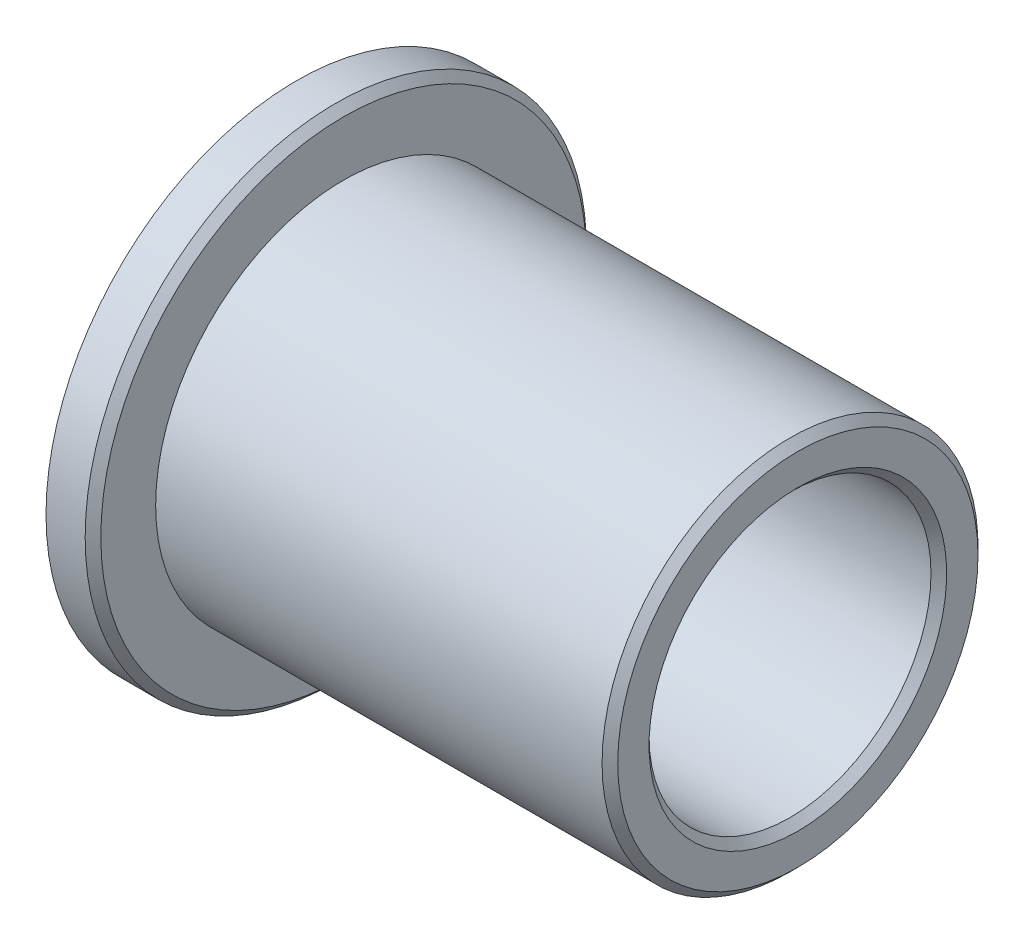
ISO-10303-21;
HEADER;
FILE_DESCRIPTION(('STEP AP214'),'2;1');
FILE_NAME('part.step','',(''),(''),'','','');
FILE_SCHEMA(('AUTOMOTIVE_DESIGN { 1 0 10303 214 1 1 1 1 }'));
ENDSEC;
DATA;
#1=APPLICATION_CONTEXT('core data for automotive mechanical design processes');
#2=APPLICATION_PROTOCOL_DEFINITION('international standard','automotive_design',2000,#1);
#3=PRODUCT_CONTEXT('',#1,'mechanical');
#4=PRODUCT('Part','Part','',(#3));
#5=PRODUCT_RELATED_PRODUCT_CATEGORY('part','',(#4));
#6=PRODUCT_DEFINITION_FORMATION('','',#4);
#7=PRODUCT_DEFINITION_CONTEXT('part definition',#1,'design');
#8=PRODUCT_DEFINITION('design','',#6,#7);
#9=PRODUCT_DEFINITION_SHAPE('','',#8);
#10=(LENGTH_UNIT() NAMED_UNIT(*) SI_UNIT(.MILLI.,.METRE.));
#11=(NAMED_UNIT(*) PLANE_ANGLE_UNIT() SI_UNIT($,.RADIAN.));
#12=(NAMED_UNIT(*) SI_UNIT($,.STERADIAN.) SOLID_ANGLE_UNIT());
#13=UNCERTAINTY_MEASURE_WITH_UNIT(LENGTH_MEASURE(1.E-05),#10,'distance_accuracy_value','');
#14=(GEOMETRIC_REPRESENTATION_CONTEXT(3) GLOBAL_UNCERTAINTY_ASSIGNED_CONTEXT((#13)) GLOBAL_UNIT_ASSIGNED_CONTEXT((#10,
#11,#12)) REPRESENTATION_CONTEXT('',''));
#15=CARTESIAN_POINT('',(0.,0.,0.));
#16=DIRECTION('',(0.,0.,1.));
#17=DIRECTION('',(1.,0.,0.));
#18=AXIS2_PLACEMENT_3D('',#15,#16,#17);
#19=CARTESIAN_POINT('',(-130.,0.,0.));
#20=DIRECTION('',(-1.,0.,0.));
#21=DIRECTION('',(0.,0.,1.));
#22=AXIS2_PLACEMENT_3D('',#19,#20,#21);
#23=CYLINDRICAL_SURFACE('',#22,16.);
#24=CARTESIAN_POINT('',(2.5,0.,0.));
#25=DIRECTION('',(-1.,0.,0.));
#26=DIRECTION('',(0.,-1.,0.));
#27=AXIS2_PLACEMENT_3D('',#24,#25,#26);
#28=CIRCLE('',#27,16.);
#29=CARTESIAN_POINT('',(2.5,-16.,0.));
#30=VERTEX_POINT('',#29);
#31=EDGE_CURVE('E362',#30,#30,#28,.T.);
#32=ORIENTED_EDGE('',*,*,#31,.T.);
#33=EDGE_LOOP('',(#32));
#34=FACE_BOUND('',#33,.T.);
#35=CARTESIAN_POINT('',(0.,0.,0.));
#36=DIRECTION('',(-1.,0.,0.));
#37=DIRECTION('',(0.,0.,1.));
#38=AXIS2_PLACEMENT_3D('',#35,#36,#37);
#39=CIRCLE('',#38,16.);
#40=CARTESIAN_POINT('',(0.,0.,16.));
#41=VERTEX_POINT('',#40);
#42=EDGE_CURVE('E390',#41,#41,#39,.T.);
#43=ORIENTED_EDGE('',*,*,#42,.F.);
#44=EDGE_LOOP('',(#43));
#45=FACE_BOUND('',#44,.T.);
#46=ADVANCED_FACE('F356',(#34,#45),#23,.T.);
#47=CARTESIAN_POINT('',(3.,16.,0.));
#48=DIRECTION('',(-1.,0.,0.));
#49=DIRECTION('',(0.,0.,1.));
#50=AXIS2_PLACEMENT_3D('',#47,#48,#49);
#51=PLANE('',#50);
#52=CARTESIAN_POINT('',(3.,0.,0.));
#53=DIRECTION('',(-1.,0.,0.));
#54=DIRECTION('',(0.,-1.,0.));
#55=AXIS2_PLACEMENT_3D('',#52,#53,#54);
#56=CIRCLE('',#55,15.5);
#57=CARTESIAN_POINT('',(3.,-15.5,0.));
#58=VERTEX_POINT('',#57);
#59=EDGE_CURVE('E12',#58,#58,#56,.F.);
#60=ORIENTED_EDGE('',*,*,#59,.T.);
#61=EDGE_LOOP('',(#60));
#62=FACE_BOUND('',#61,.T.);
#63=CARTESIAN_POINT('',(3.,0.,0.));
#64=DIRECTION('',(-1.,0.,0.));
#65=DIRECTION('',(0.,0.,1.));
#66=AXIS2_PLACEMENT_3D('',#63,#64,#65);
#67=CIRCLE('',#66,12.);
#68=CARTESIAN_POINT('',(3.,0.,12.));
#69=VERTEX_POINT('',#68);
#70=EDGE_CURVE('E387',#69,#69,#67,.T.);
#71=ORIENTED_EDGE('',*,*,#70,.T.);
#72=EDGE_LOOP('',(#71));
#73=FACE_BOUND('',#72,.T.);
#74=ADVANCED_FACE('F397',(#62,#73),#51,.F.);
#75=CARTESIAN_POINT('',(-130.,0.,0.));
#76=DIRECTION('',(-1.,0.,0.));
#77=DIRECTION('',(0.,0.,1.));
#78=AXIS2_PLACEMENT_3D('',#75,#76,#77);
#79=CYLINDRICAL_SURFACE('',#78,12.);
#80=CARTESIAN_POINT('',(31.5,0.,0.));
#81=DIRECTION('',(-1.,0.,0.));
#82=DIRECTION('',(0.,-1.,0.));
#83=AXIS2_PLACEMENT_3D('',#80,#81,#82);
#84=CIRCLE('',#83,12.);
#85=CARTESIAN_POINT('',(31.5,-12.,0.));
#86=VERTEX_POINT('',#85);
#87=EDGE_CURVE('E384',#86,#86,#84,.T.);
#88=ORIENTED_EDGE('',*,*,#87,.T.);
#89=EDGE_LOOP('',(#88));
#90=FACE_BOUND('',#89,.T.);
#91=ORIENTED_EDGE('',*,*,#70,.F.);
#92=EDGE_LOOP('',(#91));
#93=FACE_BOUND('',#92,.T.);
#94=ADVANCED_FACE('F401',(#90,#93),#79,.T.);
#95=CARTESIAN_POINT('',(32.,12.,0.));
#96=DIRECTION('',(-1.,0.,0.));
#97=DIRECTION('',(0.,0.,1.));
#98=AXIS2_PLACEMENT_3D('',#95,#96,#97);
#99=PLANE('',#98);
#100=CARTESIAN_POINT('',(32.,0.,0.));
#101=DIRECTION('',(-1.,0.,0.));
#102=DIRECTION('',(0.,-1.,0.));
#103=AXIS2_PLACEMENT_3D('',#100,#101,#102);
#104=CIRCLE('',#103,11.5);
#105=CARTESIAN_POINT('',(32.,-11.5,0.));
#106=VERTEX_POINT('',#105);
#107=EDGE_CURVE('E378',#106,#106,#104,.F.);
#108=ORIENTED_EDGE('',*,*,#107,.T.);
#109=EDGE_LOOP('',(#108));
#110=FACE_BOUND('',#109,.T.);
#111=CARTESIAN_POINT('',(32.,0.,0.));
#112=DIRECTION('',(-1.,0.,0.));
#113=DIRECTION('',(0.,-1.,0.));
#114=AXIS2_PLACEMENT_3D('',#111,#112,#113);
#115=CIRCLE('',#114,9.50000000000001);
#116=CARTESIAN_POINT('',(32.,-9.50000000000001,0.));
#117=VERTEX_POINT('',#116);
#118=EDGE_CURVE('E381',#117,#117,#115,.T.);
#119=ORIENTED_EDGE('',*,*,#118,.T.);
#120=EDGE_LOOP('',(#119));
#121=FACE_BOUND('',#120,.T.);
#122=ADVANCED_FACE('F405',(#110,#121),#99,.F.);
#123=CARTESIAN_POINT('',(-130.,0.,0.));
#124=DIRECTION('',(-1.,0.,0.));
#125=DIRECTION('',(0.,0.,1.));
#126=AXIS2_PLACEMENT_3D('',#123,#124,#125);
#127=CYLINDRICAL_SURFACE('',#126,9.);
#128=CARTESIAN_POINT('',(31.5,0.,0.));
#129=DIRECTION('',(-1.,0.,0.));
#130=DIRECTION('',(0.,-1.,0.));
#131=AXIS2_PLACEMENT_3D('',#128,#129,#130);
#132=CIRCLE('',#131,9.);
#133=CARTESIAN_POINT('',(31.5,-9.,0.));
#134=VERTEX_POINT('',#133);
#135=EDGE_CURVE('E370',#134,#134,#132,.F.);
#136=ORIENTED_EDGE('',*,*,#135,.T.);
#137=EDGE_LOOP('',(#136));
#138=FACE_BOUND('',#137,.T.);
#139=CARTESIAN_POINT('',(0.5,0.,0.));
#140=DIRECTION('',(1.,0.,0.));
#141=DIRECTION('',(0.,1.,0.));
#142=AXIS2_PLACEMENT_3D('',#139,#140,#141);
#143=CIRCLE('',#142,9.);
#144=CARTESIAN_POINT('',(0.5,9.,0.));
#145=VERTEX_POINT('',#144);
#146=EDGE_CURVE('E375',#145,#145,#143,.F.);
#147=ORIENTED_EDGE('',*,*,#146,.T.);
#148=EDGE_LOOP('',(#147));
#149=FACE_BOUND('',#148,.T.);
#150=ADVANCED_FACE('F412',(#138,#149),#127,.F.);
#151=CARTESIAN_POINT('',(0.,9.,0.));
#152=DIRECTION('',(1.,0.,0.));
#153=DIRECTION('',(0.,0.,-1.));
#154=AXIS2_PLACEMENT_3D('',#151,#152,#153);
#155=PLANE('',#154);
#156=CARTESIAN_POINT('',(0.,0.,0.));
#157=DIRECTION('',(1.,0.,0.));
#158=DIRECTION('',(0.,1.,0.));
#159=AXIS2_PLACEMENT_3D('',#156,#157,#158);
#160=CIRCLE('',#159,9.5);
#161=CARTESIAN_POINT('',(0.,9.5,0.));
#162=VERTEX_POINT('',#161);
#163=EDGE_CURVE('E366',#162,#162,#160,.T.);
#164=ORIENTED_EDGE('',*,*,#163,.T.);
#165=EDGE_LOOP('',(#164));
#166=FACE_BOUND('',#165,.T.);
#167=ORIENTED_EDGE('',*,*,#42,.T.);
#168=EDGE_LOOP('',(#167));
#169=FACE_BOUND('',#168,.T.);
#170=ADVANCED_FACE('F394',(#166,#169),#155,.F.);
#171=CARTESIAN_POINT('',(31.5,0.,0.));
#172=DIRECTION('',(-1.,0.,0.));
#173=DIRECTION('',(0.,-1.,0.));
#174=AXIS2_PLACEMENT_3D('',#171,#172,#173);
#175=CONICAL_SURFACE('',#174,12.,0.785398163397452);
#176=ORIENTED_EDGE('',*,*,#107,.F.);
#177=EDGE_LOOP('',(#176));
#178=FACE_BOUND('',#177,.T.);
#179=ORIENTED_EDGE('',*,*,#87,.F.);
#180=EDGE_LOOP('',(#179));
#181=FACE_BOUND('',#180,.T.);
#182=ADVANCED_FACE('F419',(#178,#181),#175,.T.);
#183=CARTESIAN_POINT('',(32.,0.,0.));
#184=DIRECTION('',(1.,0.,0.));
#185=DIRECTION('',(0.,1.,0.));
#186=AXIS2_PLACEMENT_3D('',#183,#184,#185);
#187=CONICAL_SURFACE('',#186,9.50000000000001,0.785398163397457);
#188=ORIENTED_EDGE('',*,*,#135,.F.);
#189=EDGE_LOOP('',(#188));
#190=FACE_BOUND('',#189,.T.);
#191=ORIENTED_EDGE('',*,*,#118,.F.);
#192=EDGE_LOOP('',(#191));
#193=FACE_BOUND('',#192,.T.);
#194=ADVANCED_FACE('F423',(#190,#193),#187,.F.);
#195=CARTESIAN_POINT('',(0.5,0.,0.));
#196=DIRECTION('',(-1.,0.,0.));
#197=DIRECTION('',(0.,-1.,0.));
#198=AXIS2_PLACEMENT_3D('',#195,#196,#197);
#199=CONICAL_SURFACE('',#198,9.,0.785398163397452);
#200=ORIENTED_EDGE('',*,*,#163,.F.);
#201=EDGE_LOOP('',(#200));
#202=FACE_BOUND('',#201,.T.);
#203=ORIENTED_EDGE('',*,*,#146,.F.);
#204=EDGE_LOOP('',(#203));
#205=FACE_BOUND('',#204,.T.);
#206=ADVANCED_FACE('F427',(#202,#205),#199,.F.);
#207=CARTESIAN_POINT('',(2.5,0.,0.));
#208=DIRECTION('',(-1.,0.,0.));
#209=DIRECTION('',(0.,-1.,0.));
#210=AXIS2_PLACEMENT_3D('',#207,#208,#209);
#211=CONICAL_SURFACE('',#210,16.,0.785398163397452);
#212=ORIENTED_EDGE('',*,*,#59,.F.);
#213=EDGE_LOOP('',(#212));
#214=FACE_BOUND('',#213,.T.);
#215=ORIENTED_EDGE('',*,*,#31,.F.);
#216=EDGE_LOOP('',(#215));
#217=FACE_BOUND('',#216,.T.);
#218=ADVANCED_FACE('F431',(#214,#217),#211,.T.);
#219=CLOSED_SHELL('',(#46,#74,#94,#122,#150,#170,#182,#194,#206,#218));
#220=MANIFOLD_SOLID_BREP('B2',#219);
#221=ADVANCED_BREP_SHAPE_REPRESENTATION('',(#18,#220),#14);
#222=SHAPE_DEFINITION_REPRESENTATION(#9,#221);
ENDSEC;
END-ISO-10303-21;
